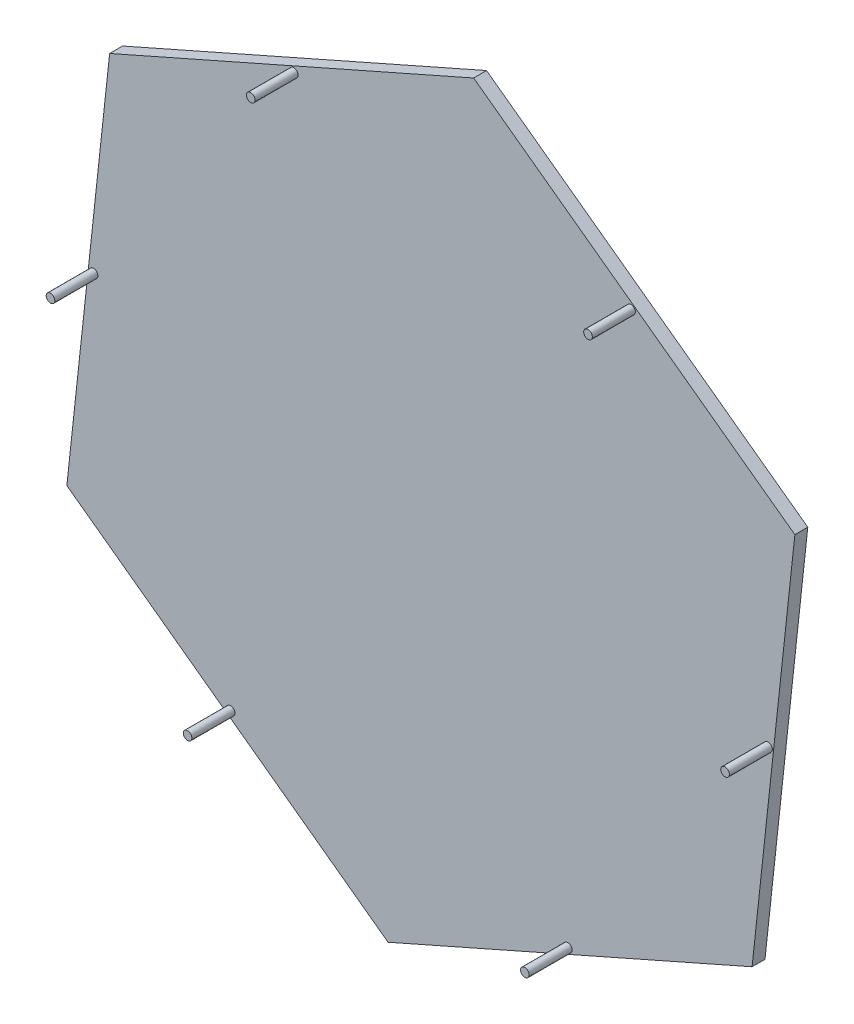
ISO-10303-21;
HEADER;
FILE_DESCRIPTION(('STEP AP214'),'2;1');
FILE_NAME('part.step','',(''),(''),'','','');
FILE_SCHEMA(('AUTOMOTIVE_DESIGN { 1 0 10303 214 1 1 1 1 }'));
ENDSEC;
DATA;
#1=APPLICATION_CONTEXT('core data for automotive mechanical design processes');
#2=APPLICATION_PROTOCOL_DEFINITION('international standard','automotive_design',2000,#1);
#3=PRODUCT_CONTEXT('',#1,'mechanical');
#4=PRODUCT('Part','Part','',(#3));
#5=PRODUCT_RELATED_PRODUCT_CATEGORY('part','',(#4));
#6=PRODUCT_DEFINITION_FORMATION('','',#4);
#7=PRODUCT_DEFINITION_CONTEXT('part definition',#1,'design');
#8=PRODUCT_DEFINITION('design','',#6,#7);
#9=PRODUCT_DEFINITION_SHAPE('','',#8);
#10=(LENGTH_UNIT() NAMED_UNIT(*) SI_UNIT(.MILLI.,.METRE.));
#11=(NAMED_UNIT(*) PLANE_ANGLE_UNIT() SI_UNIT($,.RADIAN.));
#12=(NAMED_UNIT(*) SI_UNIT($,.STERADIAN.) SOLID_ANGLE_UNIT());
#13=UNCERTAINTY_MEASURE_WITH_UNIT(LENGTH_MEASURE(1.E-05),#10,'distance_accuracy_value','');
#14=(GEOMETRIC_REPRESENTATION_CONTEXT(3) GLOBAL_UNCERTAINTY_ASSIGNED_CONTEXT((#13)) GLOBAL_UNIT_ASSIGNED_CONTEXT((#10,
#11,#12)) REPRESENTATION_CONTEXT('',''));
#15=CARTESIAN_POINT('',(0.,0.,0.));
#16=DIRECTION('',(0.,0.,1.));
#17=DIRECTION('',(1.,0.,0.));
#18=AXIS2_PLACEMENT_3D('',#15,#16,#17);
#19=CARTESIAN_POINT('',(94.7042173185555,-69.2425054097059,3.81));
#20=DIRECTION('',(-0.994203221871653,0.107517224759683,0.));
#21=DIRECTION('',(-0.107517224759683,-0.994203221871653,0.));
#22=AXIS2_PLACEMENT_3D('',#19,#20,#21);
#23=PLANE('',#22);
#24=DIRECTION('',(0.107517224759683,0.994203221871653,0.));
#25=VECTOR('',#24,1.);
#26=CARTESIAN_POINT('',(94.7042173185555,-69.2425054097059,0.));
#27=LINE('',#26,#25);
#28=CARTESIAN_POINT('',(94.7042173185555,-69.2425054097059,0.));
#29=VERTEX_POINT('',#28);
#30=CARTESIAN_POINT('',(107.317877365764,47.3950053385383,0.));
#31=VERTEX_POINT('',#30);
#32=EDGE_CURVE('E121',#29,#31,#27,.T.);
#33=ORIENTED_EDGE('',*,*,#32,.T.);
#34=DIRECTION('',(0.,0.,-1.));
#35=VECTOR('',#34,1.);
#36=CARTESIAN_POINT('',(107.317877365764,47.3950053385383,3.81));
#37=LINE('',#36,#35);
#38=CARTESIAN_POINT('',(107.317877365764,47.3950053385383,3.81));
#39=VERTEX_POINT('',#38);
#40=EDGE_CURVE('E11',#39,#31,#37,.T.);
#41=ORIENTED_EDGE('',*,*,#40,.F.);
#42=DIRECTION('',(0.107517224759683,0.994203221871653,0.));
#43=VECTOR('',#42,1.);
#44=CARTESIAN_POINT('',(94.7042173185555,-69.2425054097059,3.81));
#45=LINE('',#44,#43);
#46=CARTESIAN_POINT('',(94.7042173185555,-69.2425054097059,3.81));
#47=VERTEX_POINT('',#46);
#48=EDGE_CURVE('E137',#47,#39,#45,.T.);
#49=ORIENTED_EDGE('',*,*,#48,.F.);
#50=DIRECTION('',(0.,0.,-1.));
#51=VECTOR('',#50,1.);
#52=CARTESIAN_POINT('',(94.7042173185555,-69.2425054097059,3.81));
#53=LINE('',#52,#51);
#54=EDGE_CURVE('E122',#47,#29,#53,.T.);
#55=ORIENTED_EDGE('',*,*,#54,.T.);
#56=EDGE_LOOP('',(#33,#41,#49,#55));
#57=FACE_BOUND('',#56,.T.);
#58=ADVANCED_FACE('F41',(#57),#23,.F.);
#59=CARTESIAN_POINT('',(107.317877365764,47.3950053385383,3.81));
#60=DIRECTION('',(-0.590214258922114,-0.807246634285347,0.));
#61=DIRECTION('',(0.807246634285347,-0.590214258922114,0.));
#62=AXIS2_PLACEMENT_3D('',#59,#60,#61);
#63=PLANE('',#62);
#64=DIRECTION('',(-0.807246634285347,0.590214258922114,0.));
#65=VECTOR('',#64,1.);
#66=CARTESIAN_POINT('',(107.317877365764,47.3950053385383,0.));
#67=LINE('',#66,#65);
#68=CARTESIAN_POINT('',(12.613660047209,116.637510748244,0.));
#69=VERTEX_POINT('',#68);
#70=EDGE_CURVE('E126',#31,#69,#67,.T.);
#71=ORIENTED_EDGE('',*,*,#70,.T.);
#72=DIRECTION('',(0.,0.,-1.));
#73=VECTOR('',#72,1.);
#74=CARTESIAN_POINT('',(12.613660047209,116.637510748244,3.81));
#75=LINE('',#74,#73);
#76=CARTESIAN_POINT('',(12.613660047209,116.637510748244,3.81));
#77=VERTEX_POINT('',#76);
#78=EDGE_CURVE('E47',#77,#69,#75,.T.);
#79=ORIENTED_EDGE('',*,*,#78,.F.);
#80=DIRECTION('',(-0.807246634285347,0.590214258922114,0.));
#81=VECTOR('',#80,1.);
#82=CARTESIAN_POINT('',(107.317877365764,47.3950053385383,3.81));
#83=LINE('',#82,#81);
#84=EDGE_CURVE('E94',#39,#77,#83,.T.);
#85=ORIENTED_EDGE('',*,*,#84,.F.);
#86=ORIENTED_EDGE('',*,*,#40,.T.);
#87=EDGE_LOOP('',(#71,#79,#85,#86));
#88=FACE_BOUND('',#87,.T.);
#89=ADVANCED_FACE('F165',(#88),#63,.F.);
#90=CARTESIAN_POINT('',(12.613660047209,116.637510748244,3.81));
#91=DIRECTION('',(0.40398896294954,-0.91476385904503,0.));
#92=DIRECTION('',(0.91476385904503,0.40398896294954,0.));
#93=AXIS2_PLACEMENT_3D('',#90,#91,#92);
#94=PLANE('',#93);
#95=DIRECTION('',(-0.91476385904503,-0.40398896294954,0.));
#96=VECTOR('',#95,1.);
#97=CARTESIAN_POINT('',(12.613660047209,116.637510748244,0.));
#98=LINE('',#97,#96);
#99=CARTESIAN_POINT('',(-94.7042173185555,69.2425054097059,0.));
#100=VERTEX_POINT('',#99);
#101=EDGE_CURVE('E132',#69,#100,#98,.T.);
#102=ORIENTED_EDGE('',*,*,#101,.T.);
#103=DIRECTION('',(0.,0.,-1.));
#104=VECTOR('',#103,1.);
#105=CARTESIAN_POINT('',(-94.7042173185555,69.2425054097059,3.81));
#106=LINE('',#105,#104);
#107=CARTESIAN_POINT('',(-94.7042173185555,69.2425054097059,3.81));
#108=VERTEX_POINT('',#107);
#109=EDGE_CURVE('E117',#108,#100,#106,.T.);
#110=ORIENTED_EDGE('',*,*,#109,.F.);
#111=DIRECTION('',(-0.91476385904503,-0.40398896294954,0.));
#112=VECTOR('',#111,1.);
#113=CARTESIAN_POINT('',(12.613660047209,116.637510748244,3.81));
#114=LINE('',#113,#112);
#115=EDGE_CURVE('E110',#77,#108,#114,.T.);
#116=ORIENTED_EDGE('',*,*,#115,.F.);
#117=ORIENTED_EDGE('',*,*,#78,.T.);
#118=EDGE_LOOP('',(#102,#110,#116,#117));
#119=FACE_BOUND('',#118,.T.);
#120=ADVANCED_FACE('F142',(#119),#94,.F.);
#121=CARTESIAN_POINT('',(-94.7042173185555,69.2425054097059,3.81));
#122=DIRECTION('',(0.994203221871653,-0.107517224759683,0.));
#123=DIRECTION('',(0.107517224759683,0.994203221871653,0.));
#124=AXIS2_PLACEMENT_3D('',#121,#122,#123);
#125=PLANE('',#124);
#126=DIRECTION('',(-0.107517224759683,-0.994203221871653,0.));
#127=VECTOR('',#126,1.);
#128=CARTESIAN_POINT('',(-94.7042173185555,69.2425054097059,0.));
#129=LINE('',#128,#127);
#130=CARTESIAN_POINT('',(-107.317877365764,-47.3950053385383,0.));
#131=VERTEX_POINT('',#130);
#132=EDGE_CURVE('E113',#100,#131,#129,.T.);
#133=ORIENTED_EDGE('',*,*,#132,.T.);
#134=DIRECTION('',(0.,0.,-1.));
#135=VECTOR('',#134,1.);
#136=CARTESIAN_POINT('',(-107.317877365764,-47.3950053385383,3.81));
#137=LINE('',#136,#135);
#138=CARTESIAN_POINT('',(-107.317877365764,-47.3950053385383,3.81));
#139=VERTEX_POINT('',#138);
#140=EDGE_CURVE('E115',#139,#131,#137,.T.);
#141=ORIENTED_EDGE('',*,*,#140,.F.);
#142=DIRECTION('',(-0.107517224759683,-0.994203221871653,0.));
#143=VECTOR('',#142,1.);
#144=CARTESIAN_POINT('',(-94.7042173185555,69.2425054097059,3.81));
#145=LINE('',#144,#143);
#146=EDGE_CURVE('E101',#108,#139,#145,.T.);
#147=ORIENTED_EDGE('',*,*,#146,.F.);
#148=ORIENTED_EDGE('',*,*,#109,.T.);
#149=EDGE_LOOP('',(#133,#141,#147,#148));
#150=FACE_BOUND('',#149,.T.);
#151=ADVANCED_FACE('F114',(#150),#125,.F.);
#152=CARTESIAN_POINT('',(-107.317877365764,-47.3950053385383,3.81));
#153=DIRECTION('',(0.590214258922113,0.807246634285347,0.));
#154=DIRECTION('',(-0.807246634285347,0.590214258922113,0.));
#155=AXIS2_PLACEMENT_3D('',#152,#153,#154);
#156=PLANE('',#155);
#157=DIRECTION('',(0.807246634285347,-0.590214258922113,0.));
#158=VECTOR('',#157,1.);
#159=CARTESIAN_POINT('',(-107.317877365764,-47.3950053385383,0.));
#160=LINE('',#159,#158);
#161=CARTESIAN_POINT('',(-12.6136600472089,-116.637510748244,0.));
#162=VERTEX_POINT('',#161);
#163=EDGE_CURVE('E78',#131,#162,#160,.T.);
#164=ORIENTED_EDGE('',*,*,#163,.T.);
#165=DIRECTION('',(0.,0.,-1.));
#166=VECTOR('',#165,1.);
#167=CARTESIAN_POINT('',(-12.6136600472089,-116.637510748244,3.81));
#168=LINE('',#167,#166);
#169=CARTESIAN_POINT('',(-12.6136600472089,-116.637510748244,3.81));
#170=VERTEX_POINT('',#169);
#171=EDGE_CURVE('E120',#170,#162,#168,.T.);
#172=ORIENTED_EDGE('',*,*,#171,.F.);
#173=DIRECTION('',(0.807246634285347,-0.590214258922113,0.));
#174=VECTOR('',#173,1.);
#175=CARTESIAN_POINT('',(-107.317877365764,-47.3950053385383,3.81));
#176=LINE('',#175,#174);
#177=EDGE_CURVE('E104',#139,#170,#176,.T.);
#178=ORIENTED_EDGE('',*,*,#177,.F.);
#179=ORIENTED_EDGE('',*,*,#140,.T.);
#180=EDGE_LOOP('',(#164,#172,#178,#179));
#181=FACE_BOUND('',#180,.T.);
#182=ADVANCED_FACE('F116',(#181),#156,.F.);
#183=CARTESIAN_POINT('',(-12.6136600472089,-116.637510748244,3.81));
#184=DIRECTION('',(-0.40398896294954,0.91476385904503,0.));
#185=DIRECTION('',(-0.91476385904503,-0.40398896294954,0.));
#186=AXIS2_PLACEMENT_3D('',#183,#184,#185);
#187=PLANE('',#186);
#188=DIRECTION('',(0.91476385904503,0.40398896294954,0.));
#189=VECTOR('',#188,1.);
#190=CARTESIAN_POINT('',(-12.6136600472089,-116.637510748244,0.));
#191=LINE('',#190,#189);
#192=EDGE_CURVE('E88',#162,#29,#191,.T.);
#193=ORIENTED_EDGE('',*,*,#192,.T.);
#194=ORIENTED_EDGE('',*,*,#54,.F.);
#195=DIRECTION('',(0.91476385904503,0.40398896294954,0.));
#196=VECTOR('',#195,1.);
#197=CARTESIAN_POINT('',(-12.6136600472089,-116.637510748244,3.81));
#198=LINE('',#197,#196);
#199=EDGE_CURVE('E60',#170,#47,#198,.T.);
#200=ORIENTED_EDGE('',*,*,#199,.F.);
#201=ORIENTED_EDGE('',*,*,#171,.T.);
#202=EDGE_LOOP('',(#193,#194,#200,#201));
#203=FACE_BOUND('',#202,.T.);
#204=ADVANCED_FACE('F149',(#203),#187,.F.);
#205=CARTESIAN_POINT('',(0.,0.,3.81));
#206=DIRECTION('',(0.,0.,1.));
#207=DIRECTION('',(1.,0.,0.));
#208=AXIS2_PLACEMENT_3D('',#205,#206,#207);
#209=PLANE('',#208);
#210=CARTESIAN_POINT('',(-99.4327497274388,10.7530664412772,3.81));
#211=DIRECTION('',(0.,0.,1.));
#212=DIRECTION('',(1.,0.,0.));
#213=AXIS2_PLACEMENT_3D('',#210,#211,#212);
#214=CIRCLE('',#213,1.26999999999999);
#215=CARTESIAN_POINT('',(-98.1627497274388,10.7530664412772,3.81));
#216=VERTEX_POINT('',#215);
#217=EDGE_CURVE('E322',#216,#216,#214,.T.);
#218=ORIENTED_EDGE('',*,*,#217,.F.);
#219=EDGE_LOOP('',(#218));
#220=FACE_BOUND('',#219,.T.);
#221=CARTESIAN_POINT('',(-40.4039461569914,91.4878204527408,3.81));
#222=DIRECTION('',(0.,0.,1.));
#223=DIRECTION('',(1.,0.,0.));
#224=AXIS2_PLACEMENT_3D('',#221,#222,#223);
#225=CIRCLE('',#224,1.27);
#226=CARTESIAN_POINT('',(-39.1339461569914,91.4878204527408,3.81));
#227=VERTEX_POINT('',#226);
#228=EDGE_CURVE('E329',#227,#227,#225,.T.);
#229=ORIENTED_EDGE('',*,*,#228,.F.);
#230=EDGE_LOOP('',(#229));
#231=FACE_BOUND('',#230,.T.);
#232=CARTESIAN_POINT('',(59.0288035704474,80.7347540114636,3.81));
#233=DIRECTION('',(0.,0.,1.));
#234=DIRECTION('',(1.,0.,0.));
#235=AXIS2_PLACEMENT_3D('',#232,#233,#234);
#236=CIRCLE('',#235,1.27);
#237=CARTESIAN_POINT('',(60.2988035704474,80.7347540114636,3.81));
#238=VERTEX_POINT('',#237);
#239=EDGE_CURVE('E337',#238,#238,#236,.T.);
#240=ORIENTED_EDGE('',*,*,#239,.F.);
#241=EDGE_LOOP('',(#240));
#242=FACE_BOUND('',#241,.T.);
#243=CARTESIAN_POINT('',(99.4327497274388,-10.7530664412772,3.81));
#244=DIRECTION('',(0.,0.,1.));
#245=DIRECTION('',(1.,0.,0.));
#246=AXIS2_PLACEMENT_3D('',#243,#244,#245);
#247=CIRCLE('',#246,1.27000000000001);
#248=CARTESIAN_POINT('',(100.702749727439,-10.7530664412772,3.81));
#249=VERTEX_POINT('',#248);
#250=EDGE_CURVE('E345',#249,#249,#247,.T.);
#251=ORIENTED_EDGE('',*,*,#250,.F.);
#252=EDGE_LOOP('',(#251));
#253=FACE_BOUND('',#252,.T.);
#254=CARTESIAN_POINT('',(40.4039461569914,-91.4878204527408,3.81));
#255=DIRECTION('',(0.,0.,1.));
#256=DIRECTION('',(1.,0.,0.));
#257=AXIS2_PLACEMENT_3D('',#254,#255,#256);
#258=CIRCLE('',#257,1.27);
#259=CARTESIAN_POINT('',(41.6739461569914,-91.4878204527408,3.81));
#260=VERTEX_POINT('',#259);
#261=EDGE_CURVE('E346',#260,#260,#258,.T.);
#262=ORIENTED_EDGE('',*,*,#261,.F.);
#263=EDGE_LOOP('',(#262));
#264=FACE_BOUND('',#263,.T.);
#265=CARTESIAN_POINT('',(-59.0288035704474,-80.7347540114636,3.81));
#266=DIRECTION('',(0.,0.,1.));
#267=DIRECTION('',(1.,0.,0.));
#268=AXIS2_PLACEMENT_3D('',#265,#266,#267);
#269=CIRCLE('',#268,1.27);
#270=CARTESIAN_POINT('',(-57.7588035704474,-80.7347540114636,3.81));
#271=VERTEX_POINT('',#270);
#272=EDGE_CURVE('E352',#271,#271,#269,.T.);
#273=ORIENTED_EDGE('',*,*,#272,.F.);
#274=EDGE_LOOP('',(#273));
#275=FACE_BOUND('',#274,.T.);
#276=ORIENTED_EDGE('',*,*,#48,.T.);
#277=ORIENTED_EDGE('',*,*,#84,.T.);
#278=ORIENTED_EDGE('',*,*,#115,.T.);
#279=ORIENTED_EDGE('',*,*,#146,.T.);
#280=ORIENTED_EDGE('',*,*,#177,.T.);
#281=ORIENTED_EDGE('',*,*,#199,.T.);
#282=EDGE_LOOP('',(#276,#277,#278,#279,#280,#281));
#283=FACE_BOUND('',#282,.T.);
#284=ADVANCED_FACE('F103',(#220,#231,#242,#253,#264,#275,#283),#209,.T.);
#285=CARTESIAN_POINT('',(0.,0.,0.));
#286=DIRECTION('',(0.,0.,1.));
#287=DIRECTION('',(1.,0.,0.));
#288=AXIS2_PLACEMENT_3D('',#285,#286,#287);
#289=PLANE('',#288);
#290=ORIENTED_EDGE('',*,*,#32,.F.);
#291=ORIENTED_EDGE('',*,*,#192,.F.);
#292=ORIENTED_EDGE('',*,*,#163,.F.);
#293=ORIENTED_EDGE('',*,*,#132,.F.);
#294=ORIENTED_EDGE('',*,*,#101,.F.);
#295=ORIENTED_EDGE('',*,*,#70,.F.);
#296=EDGE_LOOP('',(#290,#291,#292,#293,#294,#295));
#297=FACE_BOUND('',#296,.T.);
#298=ADVANCED_FACE('F144',(#297),#289,.F.);
#299=CARTESIAN_POINT('',(-59.0288035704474,-80.7347540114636,16.51));
#300=DIRECTION('',(0.,0.,-1.));
#301=DIRECTION('',(-1.,0.,0.));
#302=AXIS2_PLACEMENT_3D('',#299,#300,#301);
#303=CYLINDRICAL_SURFACE('',#302,1.27);
#304=CARTESIAN_POINT('',(-59.0288035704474,-80.7347540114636,16.51));
#305=DIRECTION('',(0.,0.,1.));
#306=DIRECTION('',(1.,0.,0.));
#307=AXIS2_PLACEMENT_3D('',#304,#305,#306);
#308=CIRCLE('',#307,1.27);
#309=CARTESIAN_POINT('',(-57.7588035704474,-80.7347540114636,16.51));
#310=VERTEX_POINT('',#309);
#311=EDGE_CURVE('E129',#310,#310,#308,.T.);
#312=ORIENTED_EDGE('',*,*,#311,.F.);
#313=EDGE_LOOP('',(#312));
#314=FACE_BOUND('',#313,.T.);
#315=ORIENTED_EDGE('',*,*,#272,.T.);
#316=EDGE_LOOP('',(#315));
#317=FACE_BOUND('',#316,.T.);
#318=ADVANCED_FACE('F203',(#314,#317),#303,.T.);
#319=CARTESIAN_POINT('',(-59.0288035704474,-80.7347540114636,16.51));
#320=DIRECTION('',(0.,0.,1.));
#321=DIRECTION('',(1.,0.,0.));
#322=AXIS2_PLACEMENT_3D('',#319,#320,#321);
#323=PLANE('',#322);
#324=ORIENTED_EDGE('',*,*,#311,.T.);
#325=EDGE_LOOP('',(#324));
#326=FACE_BOUND('',#325,.T.);
#327=ADVANCED_FACE('F208',(#326),#323,.T.);
#328=CARTESIAN_POINT('',(40.4039461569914,-91.4878204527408,16.51));
#329=DIRECTION('',(0.,0.,-1.));
#330=DIRECTION('',(-1.,0.,0.));
#331=AXIS2_PLACEMENT_3D('',#328,#329,#330);
#332=CYLINDRICAL_SURFACE('',#331,1.27);
#333=CARTESIAN_POINT('',(40.4039461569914,-91.4878204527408,16.51));
#334=DIRECTION('',(0.,0.,1.));
#335=DIRECTION('',(1.,0.,0.));
#336=AXIS2_PLACEMENT_3D('',#333,#334,#335);
#337=CIRCLE('',#336,1.27);
#338=CARTESIAN_POINT('',(41.6739461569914,-91.4878204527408,16.51));
#339=VERTEX_POINT('',#338);
#340=EDGE_CURVE('E341',#339,#339,#337,.T.);
#341=ORIENTED_EDGE('',*,*,#340,.F.);
#342=EDGE_LOOP('',(#341));
#343=FACE_BOUND('',#342,.T.);
#344=ORIENTED_EDGE('',*,*,#261,.T.);
#345=EDGE_LOOP('',(#344));
#346=FACE_BOUND('',#345,.T.);
#347=ADVANCED_FACE('F217',(#343,#346),#332,.T.);
#348=CARTESIAN_POINT('',(40.4039461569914,-91.4878204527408,16.51));
#349=DIRECTION('',(0.,0.,1.));
#350=DIRECTION('',(1.,0.,0.));
#351=AXIS2_PLACEMENT_3D('',#348,#349,#350);
#352=PLANE('',#351);
#353=ORIENTED_EDGE('',*,*,#340,.T.);
#354=EDGE_LOOP('',(#353));
#355=FACE_BOUND('',#354,.T.);
#356=ADVANCED_FACE('F229',(#355),#352,.T.);
#357=CARTESIAN_POINT('',(99.4327497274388,-10.7530664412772,16.51));
#358=DIRECTION('',(0.,0.,-1.));
#359=DIRECTION('',(-1.,0.,0.));
#360=AXIS2_PLACEMENT_3D('',#357,#358,#359);
#361=CYLINDRICAL_SURFACE('',#360,1.27000000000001);
#362=CARTESIAN_POINT('',(99.4327497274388,-10.7530664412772,16.51));
#363=DIRECTION('',(0.,0.,1.));
#364=DIRECTION('',(1.,0.,0.));
#365=AXIS2_PLACEMENT_3D('',#362,#363,#364);
#366=CIRCLE('',#365,1.27000000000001);
#367=CARTESIAN_POINT('',(100.702749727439,-10.7530664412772,16.51));
#368=VERTEX_POINT('',#367);
#369=EDGE_CURVE('E336',#368,#368,#366,.T.);
#370=ORIENTED_EDGE('',*,*,#369,.F.);
#371=EDGE_LOOP('',(#370));
#372=FACE_BOUND('',#371,.T.);
#373=ORIENTED_EDGE('',*,*,#250,.T.);
#374=EDGE_LOOP('',(#373));
#375=FACE_BOUND('',#374,.T.);
#376=ADVANCED_FACE('F236',(#372,#375),#361,.T.);
#377=CARTESIAN_POINT('',(99.4327497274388,-10.7530664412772,16.51));
#378=DIRECTION('',(0.,0.,1.));
#379=DIRECTION('',(1.,0.,0.));
#380=AXIS2_PLACEMENT_3D('',#377,#378,#379);
#381=PLANE('',#380);
#382=ORIENTED_EDGE('',*,*,#369,.T.);
#383=EDGE_LOOP('',(#382));
#384=FACE_BOUND('',#383,.T.);
#385=ADVANCED_FACE('F248',(#384),#381,.T.);
#386=CARTESIAN_POINT('',(59.0288035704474,80.7347540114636,16.51));
#387=DIRECTION('',(0.,0.,-1.));
#388=DIRECTION('',(-1.,0.,0.));
#389=AXIS2_PLACEMENT_3D('',#386,#387,#388);
#390=CYLINDRICAL_SURFACE('',#389,1.27);
#391=CARTESIAN_POINT('',(59.0288035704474,80.7347540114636,16.51));
#392=DIRECTION('',(0.,0.,1.));
#393=DIRECTION('',(1.,0.,0.));
#394=AXIS2_PLACEMENT_3D('',#391,#392,#393);
#395=CIRCLE('',#394,1.27);
#396=CARTESIAN_POINT('',(60.2988035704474,80.7347540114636,16.51));
#397=VERTEX_POINT('',#396);
#398=EDGE_CURVE('E334',#397,#397,#395,.T.);
#399=ORIENTED_EDGE('',*,*,#398,.F.);
#400=EDGE_LOOP('',(#399));
#401=FACE_BOUND('',#400,.T.);
#402=ORIENTED_EDGE('',*,*,#239,.T.);
#403=EDGE_LOOP('',(#402));
#404=FACE_BOUND('',#403,.T.);
#405=ADVANCED_FACE('F256',(#401,#404),#390,.T.);
#406=CARTESIAN_POINT('',(59.0288035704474,80.7347540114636,16.51));
#407=DIRECTION('',(0.,0.,1.));
#408=DIRECTION('',(1.,0.,0.));
#409=AXIS2_PLACEMENT_3D('',#406,#407,#408);
#410=PLANE('',#409);
#411=ORIENTED_EDGE('',*,*,#398,.T.);
#412=EDGE_LOOP('',(#411));
#413=FACE_BOUND('',#412,.T.);
#414=ADVANCED_FACE('F268',(#413),#410,.T.);
#415=CARTESIAN_POINT('',(-40.4039461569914,91.4878204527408,16.51));
#416=DIRECTION('',(0.,0.,-1.));
#417=DIRECTION('',(-1.,0.,0.));
#418=AXIS2_PLACEMENT_3D('',#415,#416,#417);
#419=CYLINDRICAL_SURFACE('',#418,1.27);
#420=CARTESIAN_POINT('',(-40.4039461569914,91.4878204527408,16.51));
#421=DIRECTION('',(0.,0.,1.));
#422=DIRECTION('',(1.,0.,0.));
#423=AXIS2_PLACEMENT_3D('',#420,#421,#422);
#424=CIRCLE('',#423,1.27);
#425=CARTESIAN_POINT('',(-39.1339461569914,91.4878204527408,16.51));
#426=VERTEX_POINT('',#425);
#427=EDGE_CURVE('E330',#426,#426,#424,.T.);
#428=ORIENTED_EDGE('',*,*,#427,.F.);
#429=EDGE_LOOP('',(#428));
#430=FACE_BOUND('',#429,.T.);
#431=ORIENTED_EDGE('',*,*,#228,.T.);
#432=EDGE_LOOP('',(#431));
#433=FACE_BOUND('',#432,.T.);
#434=ADVANCED_FACE('F279',(#430,#433),#419,.T.);
#435=CARTESIAN_POINT('',(-40.4039461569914,91.4878204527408,16.51));
#436=DIRECTION('',(0.,0.,1.));
#437=DIRECTION('',(1.,0.,0.));
#438=AXIS2_PLACEMENT_3D('',#435,#436,#437);
#439=PLANE('',#438);
#440=ORIENTED_EDGE('',*,*,#427,.T.);
#441=EDGE_LOOP('',(#440));
#442=FACE_BOUND('',#441,.T.);
#443=ADVANCED_FACE('F288',(#442),#439,.T.);
#444=CARTESIAN_POINT('',(-99.4327497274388,10.7530664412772,16.51));
#445=DIRECTION('',(0.,0.,-1.));
#446=DIRECTION('',(-1.,0.,0.));
#447=AXIS2_PLACEMENT_3D('',#444,#445,#446);
#448=CYLINDRICAL_SURFACE('',#447,1.26999999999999);
#449=CARTESIAN_POINT('',(-99.4327497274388,10.7530664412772,16.51));
#450=DIRECTION('',(0.,0.,1.));
#451=DIRECTION('',(1.,0.,0.));
#452=AXIS2_PLACEMENT_3D('',#449,#450,#451);
#453=CIRCLE('',#452,1.26999999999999);
#454=CARTESIAN_POINT('',(-98.1627497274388,10.7530664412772,16.51));
#455=VERTEX_POINT('',#454);
#456=EDGE_CURVE('E323',#455,#455,#453,.T.);
#457=ORIENTED_EDGE('',*,*,#456,.F.);
#458=EDGE_LOOP('',(#457));
#459=FACE_BOUND('',#458,.T.);
#460=ORIENTED_EDGE('',*,*,#217,.T.);
#461=EDGE_LOOP('',(#460));
#462=FACE_BOUND('',#461,.T.);
#463=ADVANCED_FACE('F299',(#459,#462),#448,.T.);
#464=CARTESIAN_POINT('',(-99.4327497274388,10.7530664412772,16.51));
#465=DIRECTION('',(0.,0.,1.));
#466=DIRECTION('',(1.,0.,0.));
#467=AXIS2_PLACEMENT_3D('',#464,#465,#466);
#468=PLANE('',#467);
#469=ORIENTED_EDGE('',*,*,#456,.T.);
#470=EDGE_LOOP('',(#469));
#471=FACE_BOUND('',#470,.T.);
#472=ADVANCED_FACE('F306',(#471),#468,.T.);
#473=CLOSED_SHELL('',(#58,#89,#120,#151,#182,#204,#284,#298,#318,#327,#347,#356,#376,#385,#405,
#414,#434,#443,#463,#472));
#474=MANIFOLD_SOLID_BREP('B2',#473);
#475=ADVANCED_BREP_SHAPE_REPRESENTATION('',(#18,#474),#14);
#476=SHAPE_DEFINITION_REPRESENTATION(#9,#475);
ENDSEC;
END-ISO-10303-21;
